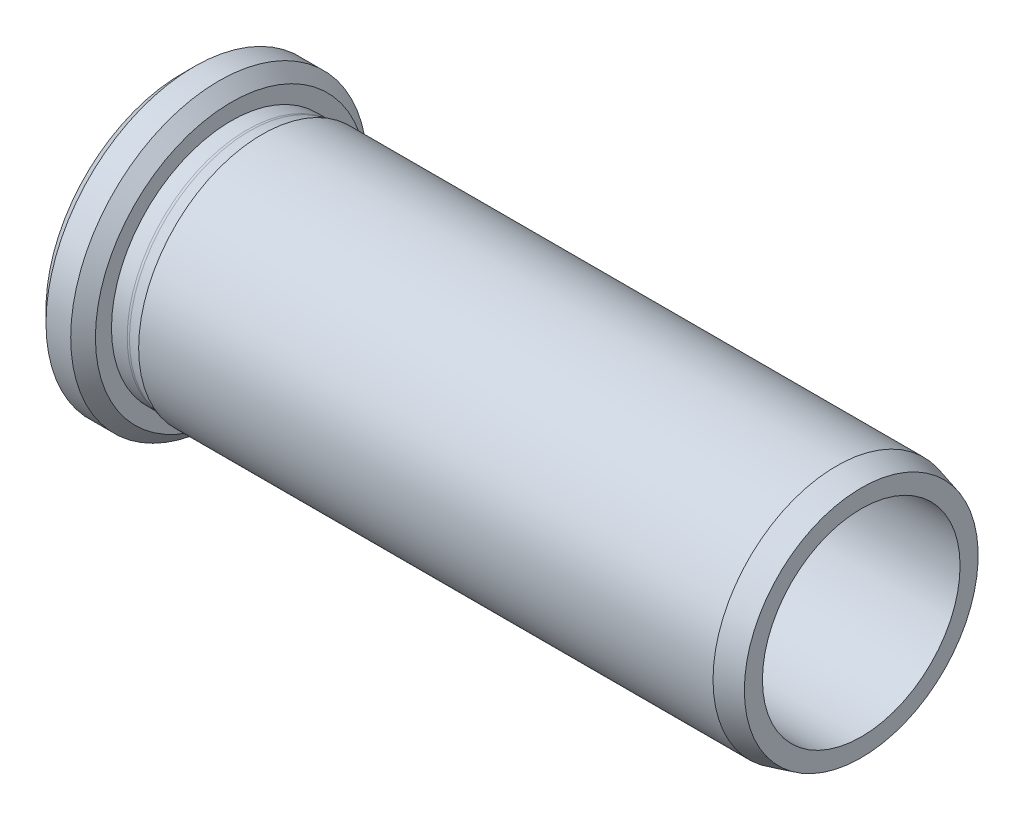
ISO-10303-21;
HEADER;
FILE_DESCRIPTION(('STEP AP214'),'2;1');
FILE_NAME('part.step','',(''),(''),'','','');
FILE_SCHEMA(('AUTOMOTIVE_DESIGN { 1 0 10303 214 1 1 1 1 }'));
ENDSEC;
DATA;
#1=APPLICATION_CONTEXT('core data for automotive mechanical design processes');
#2=APPLICATION_PROTOCOL_DEFINITION('international standard','automotive_design',2000,#1);
#3=PRODUCT_CONTEXT('',#1,'mechanical');
#4=PRODUCT('Part','Part','',(#3));
#5=PRODUCT_RELATED_PRODUCT_CATEGORY('part','',(#4));
#6=PRODUCT_DEFINITION_FORMATION('','',#4);
#7=PRODUCT_DEFINITION_CONTEXT('part definition',#1,'design');
#8=PRODUCT_DEFINITION('design','',#6,#7);
#9=PRODUCT_DEFINITION_SHAPE('','',#8);
#10=(LENGTH_UNIT() NAMED_UNIT(*) SI_UNIT(.MILLI.,.METRE.));
#11=(NAMED_UNIT(*) PLANE_ANGLE_UNIT() SI_UNIT($,.RADIAN.));
#12=(NAMED_UNIT(*) SI_UNIT($,.STERADIAN.) SOLID_ANGLE_UNIT());
#13=UNCERTAINTY_MEASURE_WITH_UNIT(LENGTH_MEASURE(1.E-05),#10,'distance_accuracy_value','');
#14=(GEOMETRIC_REPRESENTATION_CONTEXT(3) GLOBAL_UNCERTAINTY_ASSIGNED_CONTEXT((#13)) GLOBAL_UNIT_ASSIGNED_CONTEXT((#10,
#11,#12)) REPRESENTATION_CONTEXT('',''));
#15=CARTESIAN_POINT('',(0.,0.,0.));
#16=DIRECTION('',(0.,0.,1.));
#17=DIRECTION('',(1.,0.,0.));
#18=AXIS2_PLACEMENT_3D('',#15,#16,#17);
#19=CARTESIAN_POINT('',(16.075539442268,0.,0.));
#20=DIRECTION('',(-1.,0.,0.));
#21=DIRECTION('',(0.,0.,1.));
#22=AXIS2_PLACEMENT_3D('',#19,#20,#21);
#23=TOROIDAL_SURFACE('',#22,10.5,0.8);
#24=CARTESIAN_POINT('',(16.075539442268,0.,0.));
#25=DIRECTION('',(-1.,0.,0.));
#26=DIRECTION('',(0.,0.,1.));
#27=AXIS2_PLACEMENT_3D('',#24,#25,#26);
#28=CIRCLE('',#27,9.7);
#29=CARTESIAN_POINT('',(16.075539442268,0.,9.7));
#30=VERTEX_POINT('',#29);
#31=EDGE_CURVE('E58',#30,#30,#28,.T.);
#32=ORIENTED_EDGE('',*,*,#31,.F.);
#33=EDGE_LOOP('',(#32));
#34=FACE_BOUND('',#33,.T.);
#35=CARTESIAN_POINT('',(16.2825946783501,0.,0.));
#36=DIRECTION('',(-1.,0.,0.));
#37=DIRECTION('',(0.,0.,1.));
#38=AXIS2_PLACEMENT_3D('',#35,#36,#37);
#39=CIRCLE('',#38,9.72725933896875);
#40=CARTESIAN_POINT('',(16.2825946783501,0.,9.72725933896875));
#41=VERTEX_POINT('',#40);
#42=EDGE_CURVE('E40',#41,#41,#39,.T.);
#43=ORIENTED_EDGE('',*,*,#42,.T.);
#44=EDGE_LOOP('',(#43));
#45=FACE_BOUND('',#44,.T.);
#46=ADVANCED_FACE('F14',(#34,#45),#23,.F.);
#47=CARTESIAN_POINT('',(17.3004766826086,0.,0.));
#48=DIRECTION('',(1.,0.,0.));
#49=DIRECTION('',(0.,0.,-1.));
#50=AXIS2_PLACEMENT_3D('',#47,#48,#49);
#51=CONICAL_SURFACE('',#50,10.,0.261799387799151);
#52=ORIENTED_EDGE('',*,*,#42,.F.);
#53=EDGE_LOOP('',(#52));
#54=FACE_BOUND('',#53,.T.);
#55=CARTESIAN_POINT('',(17.3004766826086,0.,0.));
#56=DIRECTION('',(-1.,0.,0.));
#57=DIRECTION('',(0.,0.,1.));
#58=AXIS2_PLACEMENT_3D('',#55,#56,#57);
#59=CIRCLE('',#58,10.);
#60=CARTESIAN_POINT('',(17.3004766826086,0.,10.));
#61=VERTEX_POINT('',#60);
#62=EDGE_CURVE('E43',#61,#61,#59,.T.);
#63=ORIENTED_EDGE('',*,*,#62,.T.);
#64=EDGE_LOOP('',(#63));
#65=FACE_BOUND('',#64,.T.);
#66=ADVANCED_FACE('F66',(#54,#65),#51,.T.);
#67=CARTESIAN_POINT('',(0.,0.,0.));
#68=DIRECTION('',(-1.,0.,0.));
#69=DIRECTION('',(0.,0.,1.));
#70=AXIS2_PLACEMENT_3D('',#67,#68,#69);
#71=CYLINDRICAL_SURFACE('',#70,10.);
#72=ORIENTED_EDGE('',*,*,#62,.F.);
#73=EDGE_LOOP('',(#72));
#74=FACE_BOUND('',#73,.T.);
#75=CARTESIAN_POINT('',(63.8004766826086,0.,0.));
#76=DIRECTION('',(-1.,0.,0.));
#77=DIRECTION('',(0.,0.,1.));
#78=AXIS2_PLACEMENT_3D('',#75,#76,#77);
#79=CIRCLE('',#78,10.);
#80=CARTESIAN_POINT('',(63.8004766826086,0.,10.));
#81=VERTEX_POINT('',#80);
#82=EDGE_CURVE('E46',#81,#81,#79,.T.);
#83=ORIENTED_EDGE('',*,*,#82,.T.);
#84=EDGE_LOOP('',(#83));
#85=FACE_BOUND('',#84,.T.);
#86=ADVANCED_FACE('F72',(#74,#85),#71,.T.);
#87=CARTESIAN_POINT('',(65.8004766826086,0.,0.));
#88=DIRECTION('',(-1.,0.,0.));
#89=DIRECTION('',(0.,0.,1.));
#90=AXIS2_PLACEMENT_3D('',#87,#88,#89);
#91=CONICAL_SURFACE('',#90,9.46410161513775,0.26179938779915);
#92=ORIENTED_EDGE('',*,*,#82,.F.);
#93=EDGE_LOOP('',(#92));
#94=FACE_BOUND('',#93,.T.);
#95=CARTESIAN_POINT('',(65.8004766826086,0.,0.));
#96=DIRECTION('',(-1.,0.,0.));
#97=DIRECTION('',(0.,0.,1.));
#98=AXIS2_PLACEMENT_3D('',#95,#96,#97);
#99=CIRCLE('',#98,9.46410161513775);
#100=CARTESIAN_POINT('',(65.8004766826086,0.,9.46410161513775));
#101=VERTEX_POINT('',#100);
#102=EDGE_CURVE('E49',#101,#101,#99,.T.);
#103=ORIENTED_EDGE('',*,*,#102,.T.);
#104=EDGE_LOOP('',(#103));
#105=FACE_BOUND('',#104,.T.);
#106=ADVANCED_FACE('F78',(#94,#105),#91,.T.);
#107=CARTESIAN_POINT('',(65.8004766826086,9.46410161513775,0.));
#108=DIRECTION('',(-1.,0.,0.));
#109=DIRECTION('',(0.,0.,1.));
#110=AXIS2_PLACEMENT_3D('',#107,#108,#109);
#111=PLANE('',#110);
#112=ORIENTED_EDGE('',*,*,#102,.F.);
#113=EDGE_LOOP('',(#112));
#114=FACE_BOUND('',#113,.T.);
#115=CARTESIAN_POINT('',(65.8004766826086,0.,0.));
#116=DIRECTION('',(-1.,0.,0.));
#117=DIRECTION('',(0.,0.,1.));
#118=AXIS2_PLACEMENT_3D('',#115,#116,#117);
#119=CIRCLE('',#118,8.);
#120=CARTESIAN_POINT('',(65.8004766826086,0.,8.));
#121=VERTEX_POINT('',#120);
#122=EDGE_CURVE('E52',#121,#121,#119,.T.);
#123=ORIENTED_EDGE('',*,*,#122,.T.);
#124=EDGE_LOOP('',(#123));
#125=FACE_BOUND('',#124,.T.);
#126=ADVANCED_FACE('F84',(#114,#125),#111,.F.);
#127=CARTESIAN_POINT('',(0.,0.,0.));
#128=DIRECTION('',(-1.,0.,0.));
#129=DIRECTION('',(0.,0.,1.));
#130=AXIS2_PLACEMENT_3D('',#127,#128,#129);
#131=CYLINDRICAL_SURFACE('',#130,8.);
#132=CARTESIAN_POINT('',(12.3004766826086,0.,0.));
#133=DIRECTION('',(1.,0.,0.));
#134=DIRECTION('',(0.,0.,-1.));
#135=AXIS2_PLACEMENT_3D('',#132,#133,#134);
#136=CIRCLE('',#135,8.);
#137=CARTESIAN_POINT('',(12.3004766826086,0.,-8.));
#138=VERTEX_POINT('',#137);
#139=EDGE_CURVE('E29',#138,#138,#136,.F.);
#140=ORIENTED_EDGE('',*,*,#139,.T.);
#141=EDGE_LOOP('',(#140));
#142=FACE_BOUND('',#141,.T.);
#143=ORIENTED_EDGE('',*,*,#122,.F.);
#144=EDGE_LOOP('',(#143));
#145=FACE_BOUND('',#144,.T.);
#146=ADVANCED_FACE('F90',(#142,#145),#131,.F.);
#147=CARTESIAN_POINT('',(10.8004766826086,12.,0.));
#148=DIRECTION('',(1.,0.,0.));
#149=DIRECTION('',(0.,0.,-1.));
#150=AXIS2_PLACEMENT_3D('',#147,#148,#149);
#151=PLANE('',#150);
#152=CARTESIAN_POINT('',(10.8004766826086,0.,0.));
#153=DIRECTION('',(1.,0.,0.));
#154=DIRECTION('',(0.,0.,-1.));
#155=AXIS2_PLACEMENT_3D('',#152,#153,#154);
#156=CIRCLE('',#155,9.5);
#157=CARTESIAN_POINT('',(10.8004766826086,0.,-9.5));
#158=VERTEX_POINT('',#157);
#159=EDGE_CURVE('E25',#158,#158,#156,.T.);
#160=ORIENTED_EDGE('',*,*,#159,.T.);
#161=EDGE_LOOP('',(#160));
#162=FACE_BOUND('',#161,.T.);
#163=CARTESIAN_POINT('',(10.8004766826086,0.,0.));
#164=DIRECTION('',(1.,0.,0.));
#165=DIRECTION('',(0.,0.,-1.));
#166=AXIS2_PLACEMENT_3D('',#163,#164,#165);
#167=CIRCLE('',#166,11.);
#168=CARTESIAN_POINT('',(10.8004766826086,0.,-11.));
#169=VERTEX_POINT('',#168);
#170=EDGE_CURVE('E37',#169,#169,#167,.F.);
#171=ORIENTED_EDGE('',*,*,#170,.T.);
#172=EDGE_LOOP('',(#171));
#173=FACE_BOUND('',#172,.T.);
#174=ADVANCED_FACE('F95',(#162,#173),#151,.F.);
#175=CARTESIAN_POINT('',(0.,0.,0.));
#176=DIRECTION('',(-1.,0.,0.));
#177=DIRECTION('',(0.,0.,1.));
#178=AXIS2_PLACEMENT_3D('',#175,#176,#177);
#179=CYLINDRICAL_SURFACE('',#178,12.);
#180=CARTESIAN_POINT('',(13.8004766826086,0.,0.));
#181=DIRECTION('',(-1.,0.,0.));
#182=DIRECTION('',(0.,0.,1.));
#183=AXIS2_PLACEMENT_3D('',#180,#181,#182);
#184=CIRCLE('',#183,12.);
#185=CARTESIAN_POINT('',(13.8004766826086,0.,12.));
#186=VERTEX_POINT('',#185);
#187=EDGE_CURVE('E21',#186,#186,#184,.T.);
#188=ORIENTED_EDGE('',*,*,#187,.T.);
#189=EDGE_LOOP('',(#188));
#190=FACE_BOUND('',#189,.T.);
#191=CARTESIAN_POINT('',(11.8004766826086,0.,0.));
#192=DIRECTION('',(1.,0.,0.));
#193=DIRECTION('',(0.,0.,-1.));
#194=AXIS2_PLACEMENT_3D('',#191,#192,#193);
#195=CIRCLE('',#194,12.);
#196=CARTESIAN_POINT('',(11.8004766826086,0.,-12.));
#197=VERTEX_POINT('',#196);
#198=EDGE_CURVE('E34',#197,#197,#195,.T.);
#199=ORIENTED_EDGE('',*,*,#198,.T.);
#200=EDGE_LOOP('',(#199));
#201=FACE_BOUND('',#200,.T.);
#202=ADVANCED_FACE('F103',(#190,#201),#179,.T.);
#203=CARTESIAN_POINT('',(14.8004766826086,12.,0.));
#204=DIRECTION('',(-1.,0.,0.));
#205=DIRECTION('',(0.,0.,1.));
#206=AXIS2_PLACEMENT_3D('',#203,#204,#205);
#207=PLANE('',#206);
#208=CARTESIAN_POINT('',(14.8004766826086,0.,0.));
#209=DIRECTION('',(-1.,0.,0.));
#210=DIRECTION('',(0.,0.,1.));
#211=AXIS2_PLACEMENT_3D('',#208,#209,#210);
#212=CIRCLE('',#211,11.);
#213=CARTESIAN_POINT('',(14.8004766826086,0.,11.));
#214=VERTEX_POINT('',#213);
#215=EDGE_CURVE('E9',#214,#214,#212,.F.);
#216=ORIENTED_EDGE('',*,*,#215,.T.);
#217=EDGE_LOOP('',(#216));
#218=FACE_BOUND('',#217,.T.);
#219=CARTESIAN_POINT('',(14.8004766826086,0.,0.));
#220=DIRECTION('',(-1.,0.,0.));
#221=DIRECTION('',(0.,0.,1.));
#222=AXIS2_PLACEMENT_3D('',#219,#220,#221);
#223=CIRCLE('',#222,9.7);
#224=CARTESIAN_POINT('',(14.8004766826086,0.,9.7));
#225=VERTEX_POINT('',#224);
#226=EDGE_CURVE('E55',#225,#225,#223,.T.);
#227=ORIENTED_EDGE('',*,*,#226,.T.);
#228=EDGE_LOOP('',(#227));
#229=FACE_BOUND('',#228,.T.);
#230=ADVANCED_FACE('F142',(#218,#229),#207,.F.);
#231=CARTESIAN_POINT('',(0.,0.,0.));
#232=DIRECTION('',(-1.,0.,0.));
#233=DIRECTION('',(0.,0.,1.));
#234=AXIS2_PLACEMENT_3D('',#231,#232,#233);
#235=CYLINDRICAL_SURFACE('',#234,9.7);
#236=ORIENTED_EDGE('',*,*,#226,.F.);
#237=EDGE_LOOP('',(#236));
#238=FACE_BOUND('',#237,.T.);
#239=ORIENTED_EDGE('',*,*,#31,.T.);
#240=EDGE_LOOP('',(#239));
#241=FACE_BOUND('',#240,.T.);
#242=ADVANCED_FACE('F62',(#238,#241),#235,.T.);
#243=CARTESIAN_POINT('',(10.8004766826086,0.,0.));
#244=DIRECTION('',(1.,0.,0.));
#245=DIRECTION('',(0.,0.,-1.));
#246=AXIS2_PLACEMENT_3D('',#243,#244,#245);
#247=CONICAL_SURFACE('',#246,11.,0.785398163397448);
#248=ORIENTED_EDGE('',*,*,#198,.F.);
#249=EDGE_LOOP('',(#248));
#250=FACE_BOUND('',#249,.T.);
#251=ORIENTED_EDGE('',*,*,#170,.F.);
#252=EDGE_LOOP('',(#251));
#253=FACE_BOUND('',#252,.T.);
#254=ADVANCED_FACE('F108',(#250,#253),#247,.T.);
#255=CARTESIAN_POINT('',(12.3004766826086,0.,0.));
#256=DIRECTION('',(1.,0.,0.));
#257=DIRECTION('',(0.,0.,-1.));
#258=AXIS2_PLACEMENT_3D('',#255,#256,#257);
#259=TOROIDAL_SURFACE('',#258,9.5,1.5);
#260=ORIENTED_EDGE('',*,*,#159,.F.);
#261=EDGE_LOOP('',(#260));
#262=FACE_BOUND('',#261,.T.);
#263=ORIENTED_EDGE('',*,*,#139,.F.);
#264=EDGE_LOOP('',(#263));
#265=FACE_BOUND('',#264,.T.);
#266=ADVANCED_FACE('F110',(#262,#265),#259,.T.);
#267=CARTESIAN_POINT('',(13.8004766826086,0.,0.));
#268=DIRECTION('',(-1.,0.,0.));
#269=DIRECTION('',(0.,0.,1.));
#270=AXIS2_PLACEMENT_3D('',#267,#268,#269);
#271=CONICAL_SURFACE('',#270,12.,0.78539816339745);
#272=ORIENTED_EDGE('',*,*,#215,.F.);
#273=EDGE_LOOP('',(#272));
#274=FACE_BOUND('',#273,.T.);
#275=ORIENTED_EDGE('',*,*,#187,.F.);
#276=EDGE_LOOP('',(#275));
#277=FACE_BOUND('',#276,.T.);
#278=ADVANCED_FACE('F16',(#274,#277),#271,.T.);
#279=CLOSED_SHELL('',(#46,#66,#86,#106,#126,#146,#174,#202,#230,#242,#254,#266,#278));
#280=MANIFOLD_SOLID_BREP('B1',#279);
#281=ADVANCED_BREP_SHAPE_REPRESENTATION('',(#18,#280),#14);
#282=SHAPE_DEFINITION_REPRESENTATION(#9,#281);
ENDSEC;
END-ISO-10303-21;
